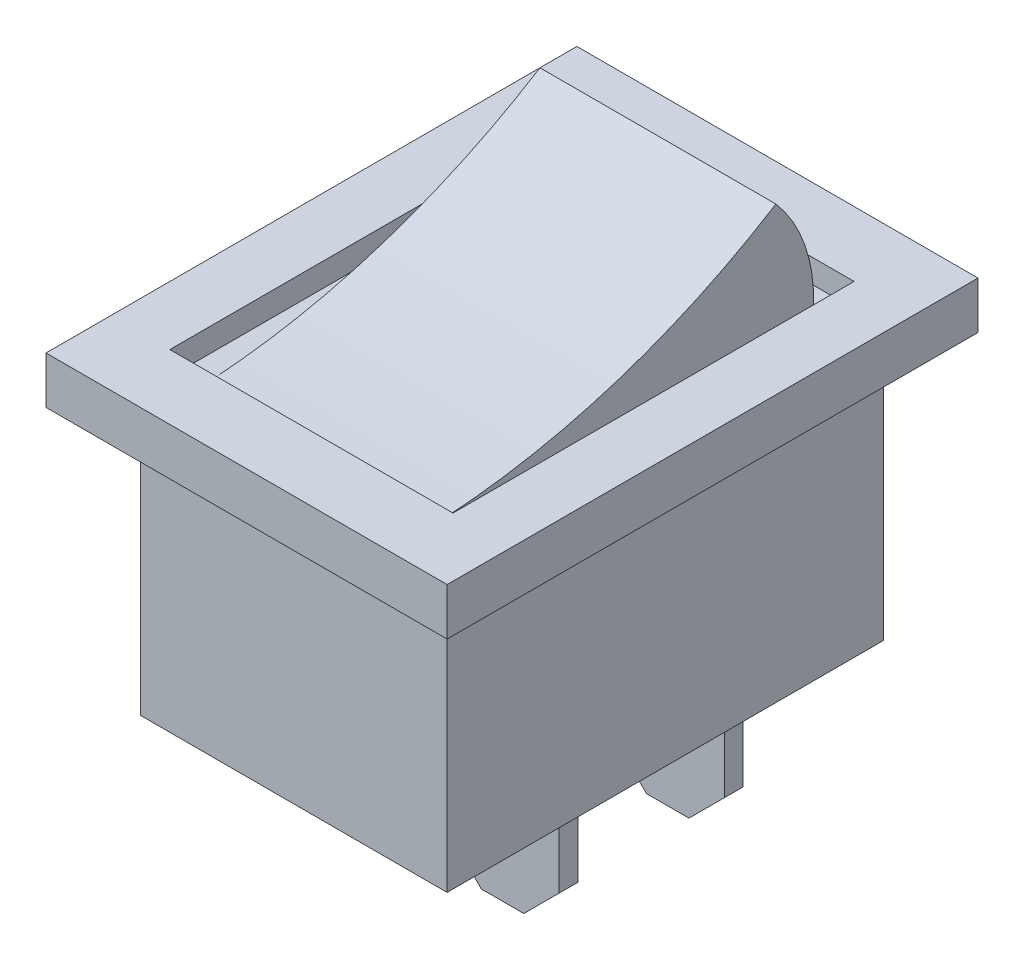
from build123d import *

# Parameters (mm, degrees)
SKETCH_1_W          = 13
SKETCH_1_H          = 18.5
EXTRUDE_1_DEPTH     = 11.3
SKETCH_2_W          = 17
SKETCH_2_H          = 22.5
EXTRUDE_2_DEPTH     = 2
SKETCH_3_W          = 12
SKETCH_3_H          = 17
CUT_EXTRUDE_1_DEPTH = 1
EXTRUDE_3_DEPTH     = 5
SKETCH_5_W          = 4.8
SKETCH_5_H          = 0.8
EXTRUDE_4_DEPTH     = 8
CHAMFER_1_SIZE      = 1.5


with BuildPart() as part:
    # Sketch 1 → Extrude 1 (new body)
    with BuildSketch(Plane(origin=(0, 0, 0), x_dir=(1, 0, 0), z_dir=(0, 1, 0))):
        Rectangle(SKETCH_1_W, SKETCH_1_H)
    extrude(amount=EXTRUDE_1_DEPTH)

    # Sketch 2 → Extrude 2 (add)
    with BuildSketch(Plane(origin=(0, 11.3, 0), x_dir=(-1, 0, 0), z_dir=(0, 1, 0))):
        Rectangle(SKETCH_2_W, SKETCH_2_H)
    extrude(amount=EXTRUDE_2_DEPTH)

    # Sketch 3 → Cut-Extrude 1 (cut)
    with BuildSketch(Plane(origin=(0, 13.3, 0), x_dir=(-1, 0, 0), z_dir=(0, 1, 0))):
        Rectangle(SKETCH_3_W, SKETCH_3_H)
    extrude(amount=-CUT_EXTRUDE_1_DEPTH, mode=Mode.SUBTRACT)

    # Sketch 4 → Extrude 3 (add, symmetric)
    with BuildSketch(Plane(origin=(0, 0, 0), x_dir=(0, 0, -1), z_dir=(1, 0, 0))):
        with BuildLine():
            Line((7.78111213, 12.3), (-7.78111213, 12.3))
            ThreePointArc((-7.78111213, 12.3), (-0.519115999, 13.683070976), (6.18418368, 16.8))
            ThreePointArc((6.18418368, 16.8), (7.403866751, 14.699479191), (7.78111213, 12.3))
        make_face()
    extrude(amount=EXTRUDE_3_DEPTH, both=True)

    # Sketch 5 → Extrude 4 (add)
    with BuildSketch(Plane.XZ):
        Rectangle(SKETCH_5_W, SKETCH_5_H)
        with Locations((0, -7)):
            Rectangle(SKETCH_5_W, SKETCH_5_H)
    extrude(amount=EXTRUDE_4_DEPTH)

    # Chamfer 1
    chamfer_1_edges = [part.edges().sort_by_distance(p)[0] for p in [
        (2.4, -8, 0),
        (-2.4, -8, 0),
        (2.4, -8, -7),
        (-2.4, -8, -7),
    ]]
    chamfer(chamfer_1_edges, length=CHAMFER_1_SIZE)


solid = part.part
